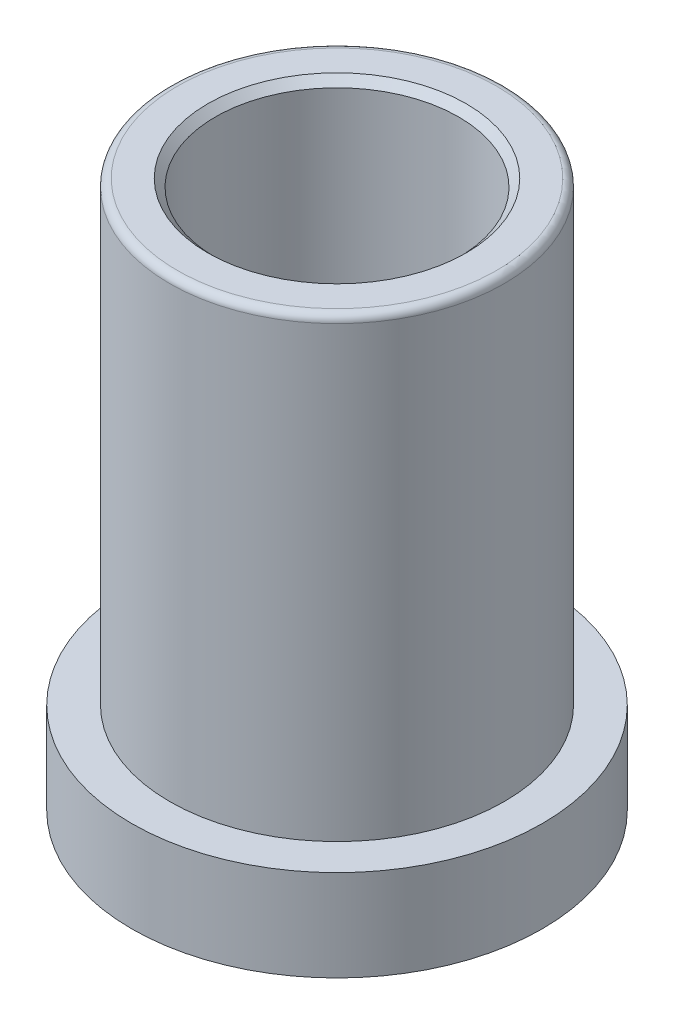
ISO-10303-21;
HEADER;
FILE_DESCRIPTION(('STEP AP214'),'2;1');
FILE_NAME('part.step','',(''),(''),'','','');
FILE_SCHEMA(('AUTOMOTIVE_DESIGN { 1 0 10303 214 1 1 1 1 }'));
ENDSEC;
DATA;
#1=APPLICATION_CONTEXT('core data for automotive mechanical design processes');
#2=APPLICATION_PROTOCOL_DEFINITION('international standard','automotive_design',2000,#1);
#3=PRODUCT_CONTEXT('',#1,'mechanical');
#4=PRODUCT('Part','Part','',(#3));
#5=PRODUCT_RELATED_PRODUCT_CATEGORY('part','',(#4));
#6=PRODUCT_DEFINITION_FORMATION('','',#4);
#7=PRODUCT_DEFINITION_CONTEXT('part definition',#1,'design');
#8=PRODUCT_DEFINITION('design','',#6,#7);
#9=PRODUCT_DEFINITION_SHAPE('','',#8);
#10=(LENGTH_UNIT() NAMED_UNIT(*) SI_UNIT(.MILLI.,.METRE.));
#11=(NAMED_UNIT(*) PLANE_ANGLE_UNIT() SI_UNIT($,.RADIAN.));
#12=(NAMED_UNIT(*) SI_UNIT($,.STERADIAN.) SOLID_ANGLE_UNIT());
#13=UNCERTAINTY_MEASURE_WITH_UNIT(LENGTH_MEASURE(1.E-05),#10,'distance_accuracy_value','');
#14=(GEOMETRIC_REPRESENTATION_CONTEXT(3) GLOBAL_UNCERTAINTY_ASSIGNED_CONTEXT((#13)) GLOBAL_UNIT_ASSIGNED_CONTEXT((#10,
#11,#12)) REPRESENTATION_CONTEXT('',''));
#15=CARTESIAN_POINT('',(0.,0.,0.));
#16=DIRECTION('',(0.,0.,1.));
#17=DIRECTION('',(1.,0.,0.));
#18=AXIS2_PLACEMENT_3D('',#15,#16,#17);
#19=CARTESIAN_POINT('',(0.,0.,0.));
#20=DIRECTION('',(0.,-1.,0.));
#21=DIRECTION('',(0.,0.,-1.));
#22=AXIS2_PLACEMENT_3D('',#19,#20,#21);
#23=CYLINDRICAL_SURFACE('',#22,11.);
#24=CARTESIAN_POINT('',(0.,29.5,0.));
#25=DIRECTION('',(0.,-1.,0.));
#26=DIRECTION('',(0.,0.,-1.));
#27=AXIS2_PLACEMENT_3D('',#24,#25,#26);
#28=CIRCLE('',#27,11.);
#29=CARTESIAN_POINT('',(0.,29.5,-11.));
#30=VERTEX_POINT('',#29);
#31=EDGE_CURVE('E21',#30,#30,#28,.T.);
#32=ORIENTED_EDGE('',*,*,#31,.T.);
#33=EDGE_LOOP('',(#32));
#34=FACE_BOUND('',#33,.T.);
#35=CARTESIAN_POINT('',(0.,0.,0.));
#36=DIRECTION('',(0.,-1.,0.));
#37=DIRECTION('',(0.,0.,-1.));
#38=AXIS2_PLACEMENT_3D('',#35,#36,#37);
#39=CIRCLE('',#38,11.);
#40=CARTESIAN_POINT('',(0.,0.,-11.));
#41=VERTEX_POINT('',#40);
#42=EDGE_CURVE('E49',#41,#41,#39,.T.);
#43=ORIENTED_EDGE('',*,*,#42,.F.);
#44=EDGE_LOOP('',(#43));
#45=FACE_BOUND('',#44,.T.);
#46=ADVANCED_FACE('F14',(#34,#45),#23,.T.);
#47=CARTESIAN_POINT('',(-11.,30.,0.));
#48=DIRECTION('',(0.,-1.,0.));
#49=DIRECTION('',(0.,0.,-1.));
#50=AXIS2_PLACEMENT_3D('',#47,#48,#49);
#51=PLANE('',#50);
#52=CARTESIAN_POINT('',(0.,30.,0.));
#53=DIRECTION('',(0.,-1.,0.));
#54=DIRECTION('',(0.,0.,-1.));
#55=AXIS2_PLACEMENT_3D('',#52,#53,#54);
#56=CIRCLE('',#55,10.5);
#57=CARTESIAN_POINT('',(0.,30.,-10.5));
#58=VERTEX_POINT('',#57);
#59=EDGE_CURVE('E9',#58,#58,#56,.F.);
#60=ORIENTED_EDGE('',*,*,#59,.T.);
#61=EDGE_LOOP('',(#60));
#62=FACE_BOUND('',#61,.T.);
#63=CARTESIAN_POINT('',(0.,30.,0.));
#64=DIRECTION('',(0.,-1.,0.));
#65=DIRECTION('',(0.,0.,-1.));
#66=AXIS2_PLACEMENT_3D('',#63,#64,#65);
#67=CIRCLE('',#66,8.5);
#68=CARTESIAN_POINT('',(0.,30.,-8.5));
#69=VERTEX_POINT('',#68);
#70=EDGE_CURVE('E37',#69,#69,#67,.T.);
#71=ORIENTED_EDGE('',*,*,#70,.T.);
#72=EDGE_LOOP('',(#71));
#73=FACE_BOUND('',#72,.T.);
#74=ADVANCED_FACE('F56',(#62,#73),#51,.F.);
#75=CARTESIAN_POINT('',(0.,0.,0.));
#76=DIRECTION('',(0.,-1.,0.));
#77=DIRECTION('',(0.,0.,-1.));
#78=AXIS2_PLACEMENT_3D('',#75,#76,#77);
#79=CYLINDRICAL_SURFACE('',#78,8.);
#80=CARTESIAN_POINT('',(0.,29.5,0.));
#81=DIRECTION('',(0.,-1.,0.));
#82=DIRECTION('',(0.,0.,-1.));
#83=AXIS2_PLACEMENT_3D('',#80,#81,#82);
#84=CIRCLE('',#83,8.);
#85=CARTESIAN_POINT('',(0.,29.5,-8.));
#86=VERTEX_POINT('',#85);
#87=EDGE_CURVE('E34',#86,#86,#84,.F.);
#88=ORIENTED_EDGE('',*,*,#87,.T.);
#89=EDGE_LOOP('',(#88));
#90=FACE_BOUND('',#89,.T.);
#91=CARTESIAN_POINT('',(0.,-6.,0.));
#92=DIRECTION('',(0.,-1.,0.));
#93=DIRECTION('',(0.,0.,-1.));
#94=AXIS2_PLACEMENT_3D('',#91,#92,#93);
#95=CIRCLE('',#94,8.);
#96=CARTESIAN_POINT('',(0.,-6.,-8.));
#97=VERTEX_POINT('',#96);
#98=EDGE_CURVE('E40',#97,#97,#95,.T.);
#99=ORIENTED_EDGE('',*,*,#98,.T.);
#100=EDGE_LOOP('',(#99));
#101=FACE_BOUND('',#100,.T.);
#102=ADVANCED_FACE('F63',(#90,#101),#79,.F.);
#103=CARTESIAN_POINT('',(0.,-6.15,0.));
#104=DIRECTION('',(0.,-1.,0.));
#105=DIRECTION('',(0.,0.,-1.));
#106=AXIS2_PLACEMENT_3D('',#103,#104,#105);
#107=CONICAL_SURFACE('',#106,8.1,0.588002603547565);
#108=CARTESIAN_POINT('',(0.,-6.36,0.));
#109=DIRECTION('',(0.,1.,0.));
#110=DIRECTION('',(0.,0.,1.));
#111=AXIS2_PLACEMENT_3D('',#108,#109,#110);
#112=CIRCLE('',#111,8.24);
#113=CARTESIAN_POINT('',(0.,-6.36,8.24));
#114=VERTEX_POINT('',#113);
#115=EDGE_CURVE('E25',#114,#114,#112,.F.);
#116=ORIENTED_EDGE('',*,*,#115,.T.);
#117=EDGE_LOOP('',(#116));
#118=FACE_BOUND('',#117,.T.);
#119=ORIENTED_EDGE('',*,*,#98,.F.);
#120=EDGE_LOOP('',(#119));
#121=FACE_BOUND('',#120,.T.);
#122=ADVANCED_FACE('F82',(#118,#121),#107,.F.);
#123=CARTESIAN_POINT('',(-8.1,-6.,0.));
#124=DIRECTION('',(0.,1.,0.));
#125=DIRECTION('',(0.,0.,1.));
#126=AXIS2_PLACEMENT_3D('',#123,#124,#125);
#127=PLANE('',#126);
#128=CARTESIAN_POINT('',(0.,-6.,0.));
#129=DIRECTION('',(0.,1.,0.));
#130=DIRECTION('',(0.,0.,1.));
#131=AXIS2_PLACEMENT_3D('',#128,#129,#130);
#132=CIRCLE('',#131,8.6);
#133=CARTESIAN_POINT('',(0.,-6.,8.6));
#134=VERTEX_POINT('',#133);
#135=EDGE_CURVE('E29',#134,#134,#132,.T.);
#136=ORIENTED_EDGE('',*,*,#135,.T.);
#137=EDGE_LOOP('',(#136));
#138=FACE_BOUND('',#137,.T.);
#139=CARTESIAN_POINT('',(0.,-6.,0.));
#140=DIRECTION('',(0.,-1.,0.));
#141=DIRECTION('',(0.,0.,-1.));
#142=AXIS2_PLACEMENT_3D('',#139,#140,#141);
#143=CIRCLE('',#142,13.5);
#144=CARTESIAN_POINT('',(0.,-6.,-13.5));
#145=VERTEX_POINT('',#144);
#146=EDGE_CURVE('E43',#145,#145,#143,.T.);
#147=ORIENTED_EDGE('',*,*,#146,.T.);
#148=EDGE_LOOP('',(#147));
#149=FACE_BOUND('',#148,.T.);
#150=ADVANCED_FACE('F85',(#138,#149),#127,.F.);
#151=CARTESIAN_POINT('',(0.,0.,0.));
#152=DIRECTION('',(0.,-1.,0.));
#153=DIRECTION('',(0.,0.,-1.));
#154=AXIS2_PLACEMENT_3D('',#151,#152,#153);
#155=CYLINDRICAL_SURFACE('',#154,13.5);
#156=ORIENTED_EDGE('',*,*,#146,.F.);
#157=EDGE_LOOP('',(#156));
#158=FACE_BOUND('',#157,.T.);
#159=CARTESIAN_POINT('',(0.,0.,0.));
#160=DIRECTION('',(0.,-1.,0.));
#161=DIRECTION('',(0.,0.,-1.));
#162=AXIS2_PLACEMENT_3D('',#159,#160,#161);
#163=CIRCLE('',#162,13.5);
#164=CARTESIAN_POINT('',(0.,0.,-13.5));
#165=VERTEX_POINT('',#164);
#166=EDGE_CURVE('E46',#165,#165,#163,.T.);
#167=ORIENTED_EDGE('',*,*,#166,.T.);
#168=EDGE_LOOP('',(#167));
#169=FACE_BOUND('',#168,.T.);
#170=ADVANCED_FACE('F97',(#158,#169),#155,.T.);
#171=CARTESIAN_POINT('',(-13.5,0.,0.));
#172=DIRECTION('',(0.,-1.,0.));
#173=DIRECTION('',(0.,0.,-1.));
#174=AXIS2_PLACEMENT_3D('',#171,#172,#173);
#175=PLANE('',#174);
#176=ORIENTED_EDGE('',*,*,#166,.F.);
#177=EDGE_LOOP('',(#176));
#178=FACE_BOUND('',#177,.T.);
#179=ORIENTED_EDGE('',*,*,#42,.T.);
#180=EDGE_LOOP('',(#179));
#181=FACE_BOUND('',#180,.T.);
#182=ADVANCED_FACE('F53',(#178,#181),#175,.F.);
#183=CARTESIAN_POINT('',(0.,30.,0.));
#184=DIRECTION('',(0.,1.,0.));
#185=DIRECTION('',(0.,0.,1.));
#186=AXIS2_PLACEMENT_3D('',#183,#184,#185);
#187=CONICAL_SURFACE('',#186,8.5,0.785398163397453);
#188=ORIENTED_EDGE('',*,*,#87,.F.);
#189=EDGE_LOOP('',(#188));
#190=FACE_BOUND('',#189,.T.);
#191=ORIENTED_EDGE('',*,*,#70,.F.);
#192=EDGE_LOOP('',(#191));
#193=FACE_BOUND('',#192,.T.);
#194=ADVANCED_FACE('F67',(#190,#193),#187,.F.);
#195=CARTESIAN_POINT('',(0.,-6.5,0.));
#196=DIRECTION('',(0.,1.,0.));
#197=DIRECTION('',(0.,0.,1.));
#198=AXIS2_PLACEMENT_3D('',#195,#196,#197);
#199=CONICAL_SURFACE('',#198,8.1,0.785398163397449);
#200=ORIENTED_EDGE('',*,*,#135,.F.);
#201=EDGE_LOOP('',(#200));
#202=FACE_BOUND('',#201,.T.);
#203=ORIENTED_EDGE('',*,*,#115,.F.);
#204=EDGE_LOOP('',(#203));
#205=FACE_BOUND('',#204,.T.);
#206=ADVANCED_FACE('F69',(#202,#205),#199,.T.);
#207=CARTESIAN_POINT('',(0.,29.5,0.));
#208=DIRECTION('',(0.,-1.,0.));
#209=DIRECTION('',(0.,0.,-1.));
#210=AXIS2_PLACEMENT_3D('',#207,#208,#209);
#211=TOROIDAL_SURFACE('',#210,10.5,0.5);
#212=ORIENTED_EDGE('',*,*,#59,.F.);
#213=EDGE_LOOP('',(#212));
#214=FACE_BOUND('',#213,.T.);
#215=ORIENTED_EDGE('',*,*,#31,.F.);
#216=EDGE_LOOP('',(#215));
#217=FACE_BOUND('',#216,.T.);
#218=ADVANCED_FACE('F16',(#214,#217),#211,.T.);
#219=CLOSED_SHELL('',(#46,#74,#102,#122,#150,#170,#182,#194,#206,#218));
#220=MANIFOLD_SOLID_BREP('B1',#219);
#221=ADVANCED_BREP_SHAPE_REPRESENTATION('',(#18,#220),#14);
#222=SHAPE_DEFINITION_REPRESENTATION(#9,#221);
ENDSEC;
END-ISO-10303-21;
